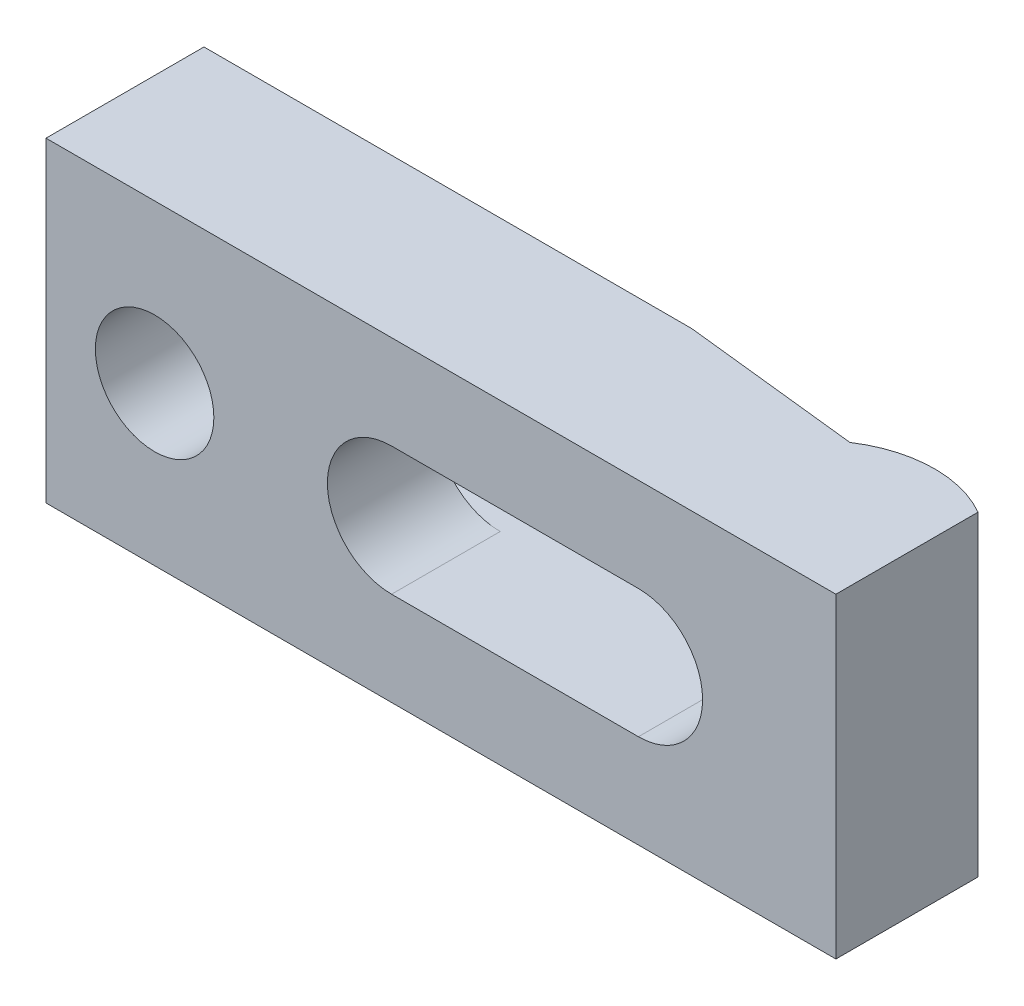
ISO-10303-21;
HEADER;
FILE_DESCRIPTION(('STEP AP214'),'2;1');
FILE_NAME('part.step','',(''),(''),'','','');
FILE_SCHEMA(('AUTOMOTIVE_DESIGN { 1 0 10303 214 1 1 1 1 }'));
ENDSEC;
DATA;
#1=APPLICATION_CONTEXT('core data for automotive mechanical design processes');
#2=APPLICATION_PROTOCOL_DEFINITION('international standard','automotive_design',2000,#1);
#3=PRODUCT_CONTEXT('',#1,'mechanical');
#4=PRODUCT('Part','Part','',(#3));
#5=PRODUCT_RELATED_PRODUCT_CATEGORY('part','',(#4));
#6=PRODUCT_DEFINITION_FORMATION('','',#4);
#7=PRODUCT_DEFINITION_CONTEXT('part definition',#1,'design');
#8=PRODUCT_DEFINITION('design','',#6,#7);
#9=PRODUCT_DEFINITION_SHAPE('','',#8);
#10=(LENGTH_UNIT() NAMED_UNIT(*) SI_UNIT(.MILLI.,.METRE.));
#11=(NAMED_UNIT(*) PLANE_ANGLE_UNIT() SI_UNIT($,.RADIAN.));
#12=(NAMED_UNIT(*) SI_UNIT($,.STERADIAN.) SOLID_ANGLE_UNIT());
#13=UNCERTAINTY_MEASURE_WITH_UNIT(LENGTH_MEASURE(1.E-05),#10,'distance_accuracy_value','');
#14=(GEOMETRIC_REPRESENTATION_CONTEXT(3) GLOBAL_UNCERTAINTY_ASSIGNED_CONTEXT((#13)) GLOBAL_UNIT_ASSIGNED_CONTEXT((#10,
#11,#12)) REPRESENTATION_CONTEXT('',''));
#15=CARTESIAN_POINT('',(0.,0.,0.));
#16=DIRECTION('',(0.,0.,1.));
#17=DIRECTION('',(1.,0.,0.));
#18=AXIS2_PLACEMENT_3D('',#15,#16,#17);
#19=CARTESIAN_POINT('',(-60.,16.,0.));
#20=DIRECTION('',(0.,0.,-1.));
#21=DIRECTION('',(-1.,0.,0.));
#22=AXIS2_PLACEMENT_3D('',#19,#20,#21);
#23=PLANE('',#22);
#24=DIRECTION('',(1.,0.,0.));
#25=VECTOR('',#24,1.);
#26=CARTESIAN_POINT('',(-25.,6.5,0.));
#27=LINE('',#26,#25);
#28=CARTESIAN_POINT('',(-60.,6.5,0.));
#29=VERTEX_POINT('',#28);
#30=CARTESIAN_POINT('',(-10.6,6.5,0.));
#31=VERTEX_POINT('',#30);
#32=EDGE_CURVE('E122',#29,#31,#27,.T.);
#33=ORIENTED_EDGE('',*,*,#32,.F.);
#34=DIRECTION('',(0.,-1.,0.));
#35=VECTOR('',#34,1.);
#36=CARTESIAN_POINT('',(-60.,16.,0.));
#37=LINE('',#36,#35);
#38=CARTESIAN_POINT('',(-60.,16.,0.));
#39=VERTEX_POINT('',#38);
#40=EDGE_CURVE('E139',#39,#29,#37,.T.);
#41=ORIENTED_EDGE('',*,*,#40,.F.);
#42=DIRECTION('',(1.,0.,0.));
#43=VECTOR('',#42,1.);
#44=CARTESIAN_POINT('',(-60.,16.,0.));
#45=LINE('',#44,#43);
#46=CARTESIAN_POINT('',(-10.6,16.,0.));
#47=VERTEX_POINT('',#46);
#48=EDGE_CURVE('E196',#39,#47,#45,.T.);
#49=ORIENTED_EDGE('',*,*,#48,.T.);
#50=DIRECTION('',(0.,-1.,0.));
#51=VECTOR('',#50,1.);
#52=CARTESIAN_POINT('',(-10.6,16.,0.));
#53=LINE('',#52,#51);
#54=EDGE_CURVE('E147',#47,#31,#53,.T.);
#55=ORIENTED_EDGE('',*,*,#54,.T.);
#56=EDGE_LOOP('',(#33,#41,#49,#55));
#57=FACE_BOUND('',#56,.T.);
#58=ADVANCED_FACE('F14',(#57),#23,.T.);
#59=CARTESIAN_POINT('',(-60.,16.,16.));
#60=DIRECTION('',(-1.,0.,0.));
#61=DIRECTION('',(0.,0.,1.));
#62=AXIS2_PLACEMENT_3D('',#59,#60,#61);
#63=PLANE('',#62);
#64=ORIENTED_EDGE('',*,*,#40,.T.);
#65=DIRECTION('',(0.,0.,1.));
#66=VECTOR('',#65,1.);
#67=CARTESIAN_POINT('',(-60.,6.5,16.));
#68=LINE('',#67,#66);
#69=CARTESIAN_POINT('',(-60.,6.5,5.));
#70=VERTEX_POINT('',#69);
#71=EDGE_CURVE('E133',#29,#70,#68,.T.);
#72=ORIENTED_EDGE('',*,*,#71,.T.);
#73=DIRECTION('',(0.,-1.,0.));
#74=VECTOR('',#73,1.);
#75=CARTESIAN_POINT('',(-60.,16.,5.));
#76=LINE('',#75,#74);
#77=CARTESIAN_POINT('',(-60.,-6.5,5.));
#78=VERTEX_POINT('',#77);
#79=EDGE_CURVE('E132',#70,#78,#76,.T.);
#80=ORIENTED_EDGE('',*,*,#79,.T.);
#81=DIRECTION('',(0.,0.,1.));
#82=VECTOR('',#81,1.);
#83=CARTESIAN_POINT('',(-60.,-6.5,16.));
#84=LINE('',#83,#82);
#85=CARTESIAN_POINT('',(-60.,-6.5,0.));
#86=VERTEX_POINT('',#85);
#87=EDGE_CURVE('E114',#86,#78,#84,.T.);
#88=ORIENTED_EDGE('',*,*,#87,.F.);
#89=CARTESIAN_POINT('',(-60.,-16.,0.));
#90=VERTEX_POINT('',#89);
#91=EDGE_CURVE('E129',#86,#90,#37,.T.);
#92=ORIENTED_EDGE('',*,*,#91,.T.);
#93=DIRECTION('',(0.,0.,-1.));
#94=VECTOR('',#93,1.);
#95=CARTESIAN_POINT('',(-60.,-16.,16.));
#96=LINE('',#95,#94);
#97=CARTESIAN_POINT('',(-60.,-16.,16.));
#98=VERTEX_POINT('',#97);
#99=EDGE_CURVE('E169',#98,#90,#96,.T.);
#100=ORIENTED_EDGE('',*,*,#99,.F.);
#101=DIRECTION('',(0.,-1.,0.));
#102=VECTOR('',#101,1.);
#103=CARTESIAN_POINT('',(-60.,16.,16.));
#104=LINE('',#103,#102);
#105=CARTESIAN_POINT('',(-60.,16.,16.));
#106=VERTEX_POINT('',#105);
#107=EDGE_CURVE('E140',#106,#98,#104,.T.);
#108=ORIENTED_EDGE('',*,*,#107,.F.);
#109=DIRECTION('',(0.,0.,-1.));
#110=VECTOR('',#109,1.);
#111=CARTESIAN_POINT('',(-60.,16.,16.));
#112=LINE('',#111,#110);
#113=EDGE_CURVE('E179',#106,#39,#112,.T.);
#114=ORIENTED_EDGE('',*,*,#113,.T.);
#115=EDGE_LOOP('',(#64,#72,#80,#88,#92,#100,#108,#114));
#116=FACE_BOUND('',#115,.T.);
#117=ADVANCED_FACE('F127',(#116),#63,.T.);
#118=CARTESIAN_POINT('',(-25.,0.,16.));
#119=DIRECTION('',(0.,0.,-1.));
#120=DIRECTION('',(-1.,0.,0.));
#121=AXIS2_PLACEMENT_3D('',#118,#119,#120);
#122=CYLINDRICAL_SURFACE('',#121,6.5);
#123=DIRECTION('',(0.,0.,-1.));
#124=VECTOR('',#123,1.);
#125=CARTESIAN_POINT('',(-25.,-6.5,16.));
#126=LINE('',#125,#124);
#127=CARTESIAN_POINT('',(-25.,-6.5,16.));
#128=VERTEX_POINT('',#127);
#129=CARTESIAN_POINT('',(-25.,-6.5,5.));
#130=VERTEX_POINT('',#129);
#131=EDGE_CURVE('E230',#128,#130,#126,.T.);
#132=ORIENTED_EDGE('',*,*,#131,.T.);
#133=CARTESIAN_POINT('',(-25.,0.,5.));
#134=DIRECTION('',(0.,0.,-1.));
#135=DIRECTION('',(-1.,0.,0.));
#136=AXIS2_PLACEMENT_3D('',#133,#134,#135);
#137=CIRCLE('',#136,6.5);
#138=CARTESIAN_POINT('',(-25.,6.5,5.));
#139=VERTEX_POINT('',#138);
#140=EDGE_CURVE('E246',#130,#139,#137,.T.);
#141=ORIENTED_EDGE('',*,*,#140,.T.);
#142=DIRECTION('',(0.,0.,-1.));
#143=VECTOR('',#142,1.);
#144=CARTESIAN_POINT('',(-25.,6.5,16.));
#145=LINE('',#144,#143);
#146=CARTESIAN_POINT('',(-25.,6.5,16.));
#147=VERTEX_POINT('',#146);
#148=EDGE_CURVE('E232',#147,#139,#145,.T.);
#149=ORIENTED_EDGE('',*,*,#148,.F.);
#150=CARTESIAN_POINT('',(-25.,0.,16.));
#151=DIRECTION('',(0.,0.,1.));
#152=DIRECTION('',(1.,0.,0.));
#153=AXIS2_PLACEMENT_3D('',#150,#151,#152);
#154=CIRCLE('',#153,6.5);
#155=EDGE_CURVE('E38',#147,#128,#154,.T.);
#156=ORIENTED_EDGE('',*,*,#155,.T.);
#157=EDGE_LOOP('',(#132,#141,#149,#156));
#158=FACE_BOUND('',#157,.T.);
#159=ADVANCED_FACE('F245',(#158),#122,.F.);
#160=CARTESIAN_POINT('',(-49.,0.,16.));
#161=DIRECTION('',(0.,0.,-1.));
#162=DIRECTION('',(-1.,0.,0.));
#163=AXIS2_PLACEMENT_3D('',#160,#161,#162);
#164=CYLINDRICAL_SURFACE('',#163,6.);
#165=CARTESIAN_POINT('',(-49.,0.,16.));
#166=DIRECTION('',(0.,0.,1.));
#167=DIRECTION('',(1.,0.,0.));
#168=AXIS2_PLACEMENT_3D('',#165,#166,#167);
#169=CIRCLE('',#168,6.);
#170=CARTESIAN_POINT('',(-43.,0.,16.));
#171=VERTEX_POINT('',#170);
#172=EDGE_CURVE('E210',#171,#171,#169,.T.);
#173=ORIENTED_EDGE('',*,*,#172,.T.);
#174=EDGE_LOOP('',(#173));
#175=FACE_BOUND('',#174,.T.);
#176=CARTESIAN_POINT('',(-49.,0.,5.));
#177=DIRECTION('',(0.,0.,-1.));
#178=DIRECTION('',(-1.,0.,0.));
#179=AXIS2_PLACEMENT_3D('',#176,#177,#178);
#180=CIRCLE('',#179,6.);
#181=CARTESIAN_POINT('',(-55.,0.,5.));
#182=VERTEX_POINT('',#181);
#183=EDGE_CURVE('E18',#182,#182,#180,.T.);
#184=ORIENTED_EDGE('',*,*,#183,.T.);
#185=EDGE_LOOP('',(#184));
#186=FACE_BOUND('',#185,.T.);
#187=ADVANCED_FACE('F278',(#175,#186),#164,.F.);
#188=CARTESIAN_POINT('',(20.,16.,16.));
#189=DIRECTION('',(0.,0.,1.));
#190=DIRECTION('',(1.,0.,0.));
#191=AXIS2_PLACEMENT_3D('',#188,#189,#190);
#192=PLANE('',#191);
#193=DIRECTION('',(1.,0.,0.));
#194=VECTOR('',#193,1.);
#195=CARTESIAN_POINT('',(-25.,6.5,16.));
#196=LINE('',#195,#194);
#197=CARTESIAN_POINT('',(0.,6.5,16.));
#198=VERTEX_POINT('',#197);
#199=EDGE_CURVE('E224',#147,#198,#196,.T.);
#200=ORIENTED_EDGE('',*,*,#199,.T.);
#201=CARTESIAN_POINT('',(0.,0.,16.));
#202=DIRECTION('',(0.,0.,1.));
#203=DIRECTION('',(1.,0.,0.));
#204=AXIS2_PLACEMENT_3D('',#201,#202,#203);
#205=CIRCLE('',#204,6.5);
#206=CARTESIAN_POINT('',(0.,-6.5,16.));
#207=VERTEX_POINT('',#206);
#208=EDGE_CURVE('E121',#207,#198,#205,.T.);
#209=ORIENTED_EDGE('',*,*,#208,.F.);
#210=DIRECTION('',(-1.,0.,0.));
#211=VECTOR('',#210,1.);
#212=CARTESIAN_POINT('',(0.,-6.5,16.));
#213=LINE('',#212,#211);
#214=EDGE_CURVE('E219',#207,#128,#213,.T.);
#215=ORIENTED_EDGE('',*,*,#214,.T.);
#216=ORIENTED_EDGE('',*,*,#155,.F.);
#217=EDGE_LOOP('',(#200,#209,#215,#216));
#218=FACE_BOUND('',#217,.T.);
#219=DIRECTION('',(0.,-1.,0.));
#220=VECTOR('',#219,1.);
#221=CARTESIAN_POINT('',(20.,16.,16.));
#222=LINE('',#221,#220);
#223=CARTESIAN_POINT('',(20.,16.,16.));
#224=VERTEX_POINT('',#223);
#225=CARTESIAN_POINT('',(20.,-16.,16.));
#226=VERTEX_POINT('',#225);
#227=EDGE_CURVE('E23',#224,#226,#222,.T.);
#228=ORIENTED_EDGE('',*,*,#227,.F.);
#229=DIRECTION('',(-1.,0.,0.));
#230=VECTOR('',#229,1.);
#231=CARTESIAN_POINT('',(20.,16.,16.));
#232=LINE('',#231,#230);
#233=EDGE_CURVE('E177',#224,#106,#232,.T.);
#234=ORIENTED_EDGE('',*,*,#233,.T.);
#235=ORIENTED_EDGE('',*,*,#107,.T.);
#236=DIRECTION('',(-1.,0.,0.));
#237=VECTOR('',#236,1.);
#238=CARTESIAN_POINT('',(20.,-16.,16.));
#239=LINE('',#238,#237);
#240=EDGE_CURVE('E165',#226,#98,#239,.T.);
#241=ORIENTED_EDGE('',*,*,#240,.F.);
#242=EDGE_LOOP('',(#228,#234,#235,#241));
#243=FACE_BOUND('',#242,.T.);
#244=ORIENTED_EDGE('',*,*,#172,.F.);
#245=EDGE_LOOP('',(#244));
#246=FACE_BOUND('',#245,.T.);
#247=ADVANCED_FACE('F166',(#218,#243,#246),#192,.T.);
#248=ORIENTED_EDGE('',*,*,#91,.F.);
#249=DIRECTION('',(-1.,0.,0.));
#250=VECTOR('',#249,1.);
#251=CARTESIAN_POINT('',(0.,-6.5,0.));
#252=LINE('',#251,#250);
#253=CARTESIAN_POINT('',(-10.6,-6.5,0.));
#254=VERTEX_POINT('',#253);
#255=EDGE_CURVE('E110',#254,#86,#252,.T.);
#256=ORIENTED_EDGE('',*,*,#255,.F.);
#257=CARTESIAN_POINT('',(-10.6,-16.,0.));
#258=VERTEX_POINT('',#257);
#259=EDGE_CURVE('E142',#254,#258,#53,.T.);
#260=ORIENTED_EDGE('',*,*,#259,.T.);
#261=DIRECTION('',(1.,0.,0.));
#262=VECTOR('',#261,1.);
#263=CARTESIAN_POINT('',(-60.,-16.,0.));
#264=LINE('',#263,#262);
#265=EDGE_CURVE('E138',#90,#258,#264,.T.);
#266=ORIENTED_EDGE('',*,*,#265,.F.);
#267=EDGE_LOOP('',(#248,#256,#260,#266));
#268=FACE_BOUND('',#267,.T.);
#269=ADVANCED_FACE('F136',(#268),#23,.T.);
#270=CARTESIAN_POINT('',(20.,16.,16.));
#271=DIRECTION('',(-1.,0.,0.));
#272=DIRECTION('',(0.,0.,1.));
#273=AXIS2_PLACEMENT_3D('',#270,#271,#272);
#274=PLANE('',#273);
#275=DIRECTION('',(0.,-1.,0.));
#276=VECTOR('',#275,1.);
#277=CARTESIAN_POINT('',(20.,16.,1.60769515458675));
#278=LINE('',#277,#276);
#279=CARTESIAN_POINT('',(20.,16.,1.60769515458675));
#280=VERTEX_POINT('',#279);
#281=CARTESIAN_POINT('',(20.,-16.,1.60769515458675));
#282=VERTEX_POINT('',#281);
#283=EDGE_CURVE('E152',#280,#282,#278,.T.);
#284=ORIENTED_EDGE('',*,*,#283,.F.);
#285=DIRECTION('',(0.,0.,-1.));
#286=VECTOR('',#285,1.);
#287=CARTESIAN_POINT('',(20.,16.,16.));
#288=LINE('',#287,#286);
#289=EDGE_CURVE('E143',#224,#280,#288,.T.);
#290=ORIENTED_EDGE('',*,*,#289,.F.);
#291=ORIENTED_EDGE('',*,*,#227,.T.);
#292=DIRECTION('',(0.,0.,-1.));
#293=VECTOR('',#292,1.);
#294=CARTESIAN_POINT('',(20.,-16.,16.));
#295=LINE('',#294,#293);
#296=EDGE_CURVE('E159',#226,#282,#295,.T.);
#297=ORIENTED_EDGE('',*,*,#296,.T.);
#298=EDGE_LOOP('',(#284,#290,#291,#297));
#299=FACE_BOUND('',#298,.T.);
#300=ADVANCED_FACE('F16',(#299),#274,.F.);
#301=CARTESIAN_POINT('',(14.,16.,12.));
#302=DIRECTION('',(0.,-1.,0.));
#303=DIRECTION('',(0.,0.,-1.));
#304=AXIS2_PLACEMENT_3D('',#301,#302,#303);
#305=CYLINDRICAL_SURFACE('',#304,12.);
#306=DIRECTION('',(0.,-1.,0.));
#307=VECTOR('',#306,1.);
#308=CARTESIAN_POINT('',(7.4,16.,1.97802414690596));
#309=LINE('',#308,#307);
#310=CARTESIAN_POINT('',(7.4,16.,1.97802414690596));
#311=VERTEX_POINT('',#310);
#312=CARTESIAN_POINT('',(7.4,-16.,1.97802414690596));
#313=VERTEX_POINT('',#312);
#314=EDGE_CURVE('E150',#311,#313,#309,.T.);
#315=ORIENTED_EDGE('',*,*,#314,.F.);
#316=CARTESIAN_POINT('',(14.,16.,12.));
#317=DIRECTION('',(0.,1.,0.));
#318=DIRECTION('',(0.,0.,1.));
#319=AXIS2_PLACEMENT_3D('',#316,#317,#318);
#320=CIRCLE('',#319,12.);
#321=EDGE_CURVE('E190',#280,#311,#320,.T.);
#322=ORIENTED_EDGE('',*,*,#321,.F.);
#323=ORIENTED_EDGE('',*,*,#283,.T.);
#324=CARTESIAN_POINT('',(14.,-16.,12.));
#325=DIRECTION('',(0.,1.,0.));
#326=DIRECTION('',(0.,0.,1.));
#327=AXIS2_PLACEMENT_3D('',#324,#325,#326);
#328=CIRCLE('',#327,12.);
#329=EDGE_CURVE('E176',#282,#313,#328,.T.);
#330=ORIENTED_EDGE('',*,*,#329,.T.);
#331=EDGE_LOOP('',(#315,#322,#323,#330));
#332=FACE_BOUND('',#331,.T.);
#333=ADVANCED_FACE('F277',(#332),#305,.T.);
#334=CARTESIAN_POINT('',(7.4,16.,1.97802414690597));
#335=DIRECTION('',(-0.109232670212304,0.,0.99401620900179));
#336=DIRECTION('',(0.99401620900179,0.,0.109232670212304));
#337=AXIS2_PLACEMENT_3D('',#334,#335,#336);
#338=PLANE('',#337);
#339=CARTESIAN_POINT('',(0.,0.,1.16483644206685));
#340=DIRECTION('',(-0.109232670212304,0.,0.99401620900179));
#341=DIRECTION('',(-0.99401620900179,0.,-0.109232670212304));
#342=AXIS2_PLACEMENT_3D('',#339,#340,#341);
#343=ELLIPSE('',#342,6.53912877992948,6.5);
#344=CARTESIAN_POINT('',(0.,6.5,1.16483644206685));
#345=VERTEX_POINT('',#344);
#346=CARTESIAN_POINT('',(0.,-6.5,1.16483644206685));
#347=VERTEX_POINT('',#346);
#348=EDGE_CURVE('E9',#345,#347,#343,.F.);
#349=ORIENTED_EDGE('',*,*,#348,.F.);
#350=DIRECTION('',(-0.99401620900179,0.,-0.109232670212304));
#351=VECTOR('',#350,1.);
#352=CARTESIAN_POINT('',(7.4,6.5,1.97802414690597));
#353=LINE('',#352,#351);
#354=EDGE_CURVE('E170',#345,#31,#353,.T.);
#355=ORIENTED_EDGE('',*,*,#354,.T.);
#356=ORIENTED_EDGE('',*,*,#54,.F.);
#357=DIRECTION('',(-0.99401620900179,0.,-0.109232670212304));
#358=VECTOR('',#357,1.);
#359=CARTESIAN_POINT('',(7.4,16.,1.97802414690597));
#360=LINE('',#359,#358);
#361=EDGE_CURVE('E193',#311,#47,#360,.T.);
#362=ORIENTED_EDGE('',*,*,#361,.F.);
#363=ORIENTED_EDGE('',*,*,#314,.T.);
#364=DIRECTION('',(-0.99401620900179,0.,-0.109232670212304));
#365=VECTOR('',#364,1.);
#366=CARTESIAN_POINT('',(7.4,-16.,1.97802414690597));
#367=LINE('',#366,#365);
#368=EDGE_CURVE('E180',#313,#258,#367,.T.);
#369=ORIENTED_EDGE('',*,*,#368,.T.);
#370=ORIENTED_EDGE('',*,*,#259,.F.);
#371=DIRECTION('',(0.99401620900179,0.,0.109232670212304));
#372=VECTOR('',#371,1.);
#373=CARTESIAN_POINT('',(7.4,-6.5,1.97802414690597));
#374=LINE('',#373,#372);
#375=EDGE_CURVE('E117',#254,#347,#374,.T.);
#376=ORIENTED_EDGE('',*,*,#375,.T.);
#377=EDGE_LOOP('',(#349,#355,#356,#362,#363,#369,#370,#376));
#378=FACE_BOUND('',#377,.T.);
#379=ADVANCED_FACE('F237',(#378),#338,.F.);
#380=CARTESIAN_POINT('',(14.,16.,12.));
#381=DIRECTION('',(0.,1.,0.));
#382=DIRECTION('',(0.,0.,1.));
#383=AXIS2_PLACEMENT_3D('',#380,#381,#382);
#384=PLANE('',#383);
#385=ORIENTED_EDGE('',*,*,#233,.F.);
#386=ORIENTED_EDGE('',*,*,#289,.T.);
#387=ORIENTED_EDGE('',*,*,#321,.T.);
#388=ORIENTED_EDGE('',*,*,#361,.T.);
#389=ORIENTED_EDGE('',*,*,#48,.F.);
#390=ORIENTED_EDGE('',*,*,#113,.F.);
#391=EDGE_LOOP('',(#385,#386,#387,#388,#389,#390));
#392=FACE_BOUND('',#391,.T.);
#393=ADVANCED_FACE('F203',(#392),#384,.T.);
#394=CARTESIAN_POINT('',(14.,-16.,12.));
#395=DIRECTION('',(0.,1.,0.));
#396=DIRECTION('',(0.,0.,1.));
#397=AXIS2_PLACEMENT_3D('',#394,#395,#396);
#398=PLANE('',#397);
#399=ORIENTED_EDGE('',*,*,#240,.T.);
#400=ORIENTED_EDGE('',*,*,#99,.T.);
#401=ORIENTED_EDGE('',*,*,#265,.T.);
#402=ORIENTED_EDGE('',*,*,#368,.F.);
#403=ORIENTED_EDGE('',*,*,#329,.F.);
#404=ORIENTED_EDGE('',*,*,#296,.F.);
#405=EDGE_LOOP('',(#399,#400,#401,#402,#403,#404));
#406=FACE_BOUND('',#405,.T.);
#407=ADVANCED_FACE('F173',(#406),#398,.F.);
#408=CARTESIAN_POINT('',(0.,0.,16.));
#409=DIRECTION('',(0.,0.,-1.));
#410=DIRECTION('',(-1.,0.,0.));
#411=AXIS2_PLACEMENT_3D('',#408,#409,#410);
#412=CYLINDRICAL_SURFACE('',#411,6.5);
#413=ORIENTED_EDGE('',*,*,#348,.T.);
#414=DIRECTION('',(0.,0.,-1.));
#415=VECTOR('',#414,1.);
#416=CARTESIAN_POINT('',(0.,-6.5,16.));
#417=LINE('',#416,#415);
#418=EDGE_CURVE('E222',#207,#347,#417,.T.);
#419=ORIENTED_EDGE('',*,*,#418,.F.);
#420=ORIENTED_EDGE('',*,*,#208,.T.);
#421=DIRECTION('',(0.,0.,-1.));
#422=VECTOR('',#421,1.);
#423=CARTESIAN_POINT('',(0.,6.5,16.));
#424=LINE('',#423,#422);
#425=EDGE_CURVE('E234',#198,#345,#424,.T.);
#426=ORIENTED_EDGE('',*,*,#425,.T.);
#427=EDGE_LOOP('',(#413,#419,#420,#426));
#428=FACE_BOUND('',#427,.T.);
#429=ADVANCED_FACE('F241',(#428),#412,.F.);
#430=CARTESIAN_POINT('',(-25.,6.5,16.));
#431=DIRECTION('',(0.,1.,0.));
#432=DIRECTION('',(-1.,0.,0.));
#433=AXIS2_PLACEMENT_3D('',#430,#431,#432);
#434=PLANE('',#433);
#435=ORIENTED_EDGE('',*,*,#354,.F.);
#436=ORIENTED_EDGE('',*,*,#425,.F.);
#437=ORIENTED_EDGE('',*,*,#199,.F.);
#438=ORIENTED_EDGE('',*,*,#148,.T.);
#439=DIRECTION('',(-1.,0.,0.));
#440=VECTOR('',#439,1.);
#441=CARTESIAN_POINT('',(0.,6.5,5.));
#442=LINE('',#441,#440);
#443=EDGE_CURVE('E30',#139,#70,#442,.T.);
#444=ORIENTED_EDGE('',*,*,#443,.T.);
#445=ORIENTED_EDGE('',*,*,#71,.F.);
#446=ORIENTED_EDGE('',*,*,#32,.T.);
#447=EDGE_LOOP('',(#435,#436,#437,#438,#444,#445,#446));
#448=FACE_BOUND('',#447,.T.);
#449=ADVANCED_FACE('F212',(#448),#434,.F.);
#450=CARTESIAN_POINT('',(0.,-6.5,16.));
#451=DIRECTION('',(0.,-1.,0.));
#452=DIRECTION('',(1.,0.,0.));
#453=AXIS2_PLACEMENT_3D('',#450,#451,#452);
#454=PLANE('',#453);
#455=ORIENTED_EDGE('',*,*,#255,.T.);
#456=ORIENTED_EDGE('',*,*,#87,.T.);
#457=DIRECTION('',(-1.,0.,0.));
#458=VECTOR('',#457,1.);
#459=CARTESIAN_POINT('',(0.,-6.5,5.));
#460=LINE('',#459,#458);
#461=EDGE_CURVE('E244',#130,#78,#460,.T.);
#462=ORIENTED_EDGE('',*,*,#461,.F.);
#463=ORIENTED_EDGE('',*,*,#131,.F.);
#464=ORIENTED_EDGE('',*,*,#214,.F.);
#465=ORIENTED_EDGE('',*,*,#418,.T.);
#466=ORIENTED_EDGE('',*,*,#375,.F.);
#467=EDGE_LOOP('',(#455,#456,#462,#463,#464,#465,#466));
#468=FACE_BOUND('',#467,.T.);
#469=ADVANCED_FACE('F112',(#468),#454,.F.);
#470=CARTESIAN_POINT('',(0.,-6.5,5.));
#471=DIRECTION('',(0.,0.,-1.));
#472=DIRECTION('',(-1.,0.,0.));
#473=AXIS2_PLACEMENT_3D('',#470,#471,#472);
#474=PLANE('',#473);
#475=ORIENTED_EDGE('',*,*,#183,.F.);
#476=EDGE_LOOP('',(#475));
#477=FACE_BOUND('',#476,.T.);
#478=ORIENTED_EDGE('',*,*,#443,.F.);
#479=ORIENTED_EDGE('',*,*,#140,.F.);
#480=ORIENTED_EDGE('',*,*,#461,.T.);
#481=ORIENTED_EDGE('',*,*,#79,.F.);
#482=EDGE_LOOP('',(#478,#479,#480,#481));
#483=FACE_BOUND('',#482,.T.);
#484=ADVANCED_FACE('F251',(#477,#483),#474,.T.);
#485=CLOSED_SHELL('',(#58,#117,#159,#187,#247,#269,#300,#333,#379,#393,#407,#429,#449,#469,#484));
#486=MANIFOLD_SOLID_BREP('B1',#485);
#487=ADVANCED_BREP_SHAPE_REPRESENTATION('',(#18,#486),#14);
#488=SHAPE_DEFINITION_REPRESENTATION(#9,#487);
ENDSEC;
END-ISO-10303-21;
